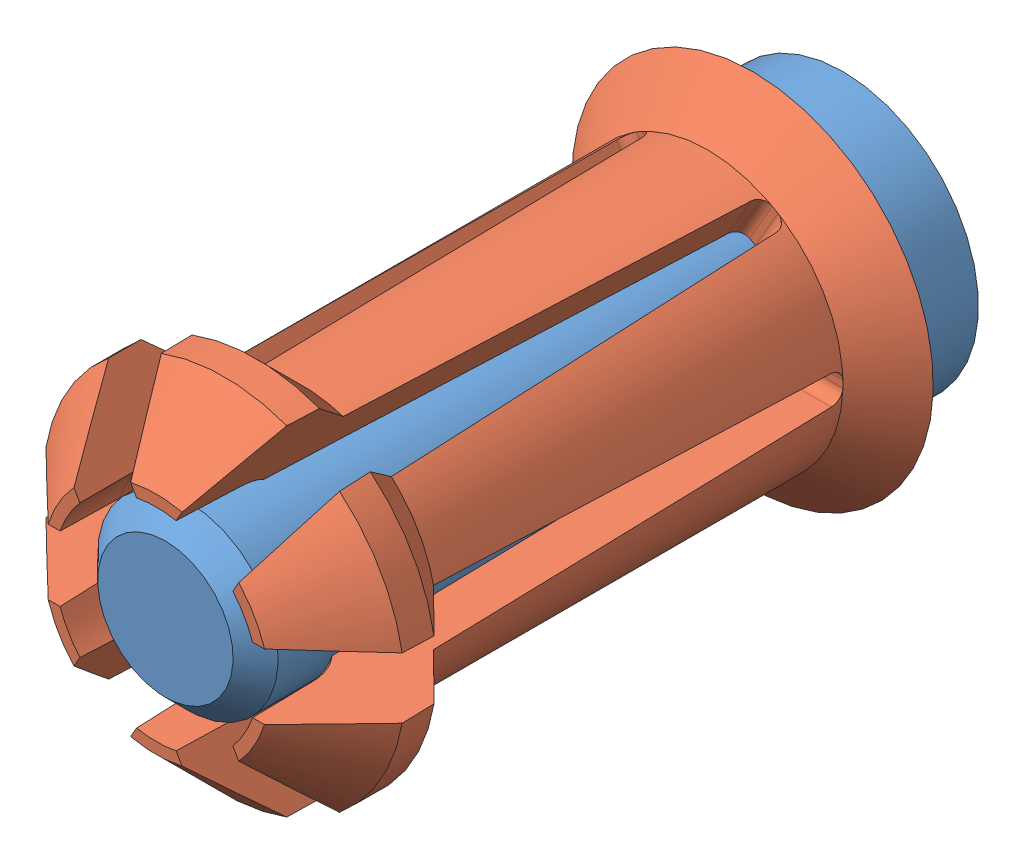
SolidWorks assembly Clipper Assembly.SLDASM, configuration Predeterminado (file format 16000). Lengths in mm.
Overall size (8 8 15.2).
2 component instances, 2 part files, 0 mates.
Components (placement in the parent):
- Pin Clip-1: Pin Clip.SLDPRT [Predeterminado] at (-27.4757 -10.0621 -8.6012) x (1 0 0) z (0 -1 0) size (6 15 6)
- clipper 4_2-1: clipper 4_2.SLDPRT [Predeterminado] at (-27.4757 -10.0621 -6.6012) x (1 0 0) z (0 -1 0) size (8 13.2 8)
